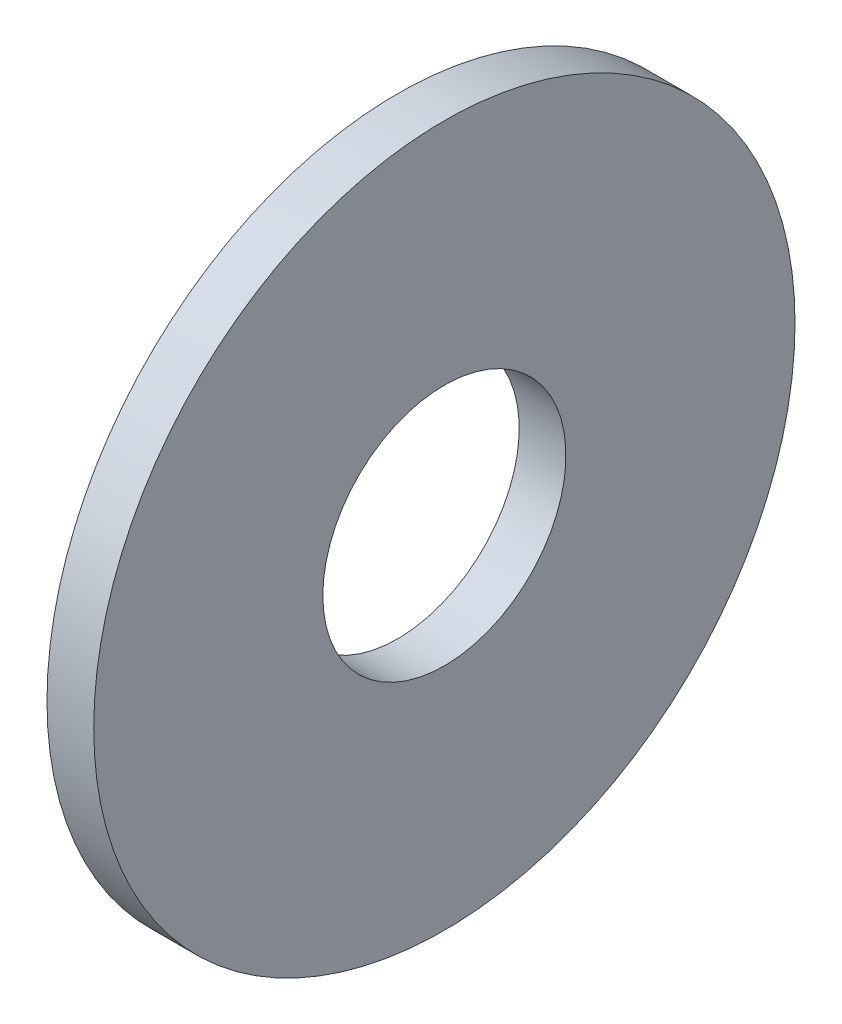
ISO-10303-21;
HEADER;
FILE_DESCRIPTION(('STEP AP214'),'2;1');
FILE_NAME('part.step','',(''),(''),'','','');
FILE_SCHEMA(('AUTOMOTIVE_DESIGN { 1 0 10303 214 1 1 1 1 }'));
ENDSEC;
DATA;
#1=APPLICATION_CONTEXT('core data for automotive mechanical design processes');
#2=APPLICATION_PROTOCOL_DEFINITION('international standard','automotive_design',2000,#1);
#3=PRODUCT_CONTEXT('',#1,'mechanical');
#4=PRODUCT('Part','Part','',(#3));
#5=PRODUCT_RELATED_PRODUCT_CATEGORY('part','',(#4));
#6=PRODUCT_DEFINITION_FORMATION('','',#4);
#7=PRODUCT_DEFINITION_CONTEXT('part definition',#1,'design');
#8=PRODUCT_DEFINITION('design','',#6,#7);
#9=PRODUCT_DEFINITION_SHAPE('','',#8);
#10=(LENGTH_UNIT() NAMED_UNIT(*) SI_UNIT(.MILLI.,.METRE.));
#11=(NAMED_UNIT(*) PLANE_ANGLE_UNIT() SI_UNIT($,.RADIAN.));
#12=(NAMED_UNIT(*) SI_UNIT($,.STERADIAN.) SOLID_ANGLE_UNIT());
#13=UNCERTAINTY_MEASURE_WITH_UNIT(LENGTH_MEASURE(1.E-05),#10,'distance_accuracy_value','');
#14=(GEOMETRIC_REPRESENTATION_CONTEXT(3) GLOBAL_UNCERTAINTY_ASSIGNED_CONTEXT((#13)) GLOBAL_UNIT_ASSIGNED_CONTEXT((#10,
#11,#12)) REPRESENTATION_CONTEXT('',''));
#15=CARTESIAN_POINT('',(0.,0.,0.));
#16=DIRECTION('',(0.,0.,1.));
#17=DIRECTION('',(1.,0.,0.));
#18=AXIS2_PLACEMENT_3D('',#15,#16,#17);
#19=CARTESIAN_POINT('',(-7.4558363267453,0.,0.));
#20=DIRECTION('',(-1.,0.,0.));
#21=DIRECTION('',(0.,0.,1.));
#22=AXIS2_PLACEMENT_3D('',#19,#20,#21);
#23=CYLINDRICAL_SURFACE('',#22,5.2);
#24=CARTESIAN_POINT('',(2.,0.,0.));
#25=DIRECTION('',(-1.,0.,0.));
#26=DIRECTION('',(0.,0.,1.));
#27=AXIS2_PLACEMENT_3D('',#24,#25,#26);
#28=CIRCLE('',#27,5.2);
#29=CARTESIAN_POINT('',(2.,0.,5.2));
#30=VERTEX_POINT('',#29);
#31=EDGE_CURVE('E10',#30,#30,#28,.T.);
#32=ORIENTED_EDGE('',*,*,#31,.F.);
#33=EDGE_LOOP('',(#32));
#34=FACE_BOUND('',#33,.T.);
#35=CARTESIAN_POINT('',(0.,0.,0.));
#36=DIRECTION('',(-1.,0.,0.));
#37=DIRECTION('',(0.,0.,1.));
#38=AXIS2_PLACEMENT_3D('',#35,#36,#37);
#39=CIRCLE('',#38,5.2);
#40=CARTESIAN_POINT('',(0.,0.,5.2));
#41=VERTEX_POINT('',#40);
#42=EDGE_CURVE('E43',#41,#41,#39,.T.);
#43=ORIENTED_EDGE('',*,*,#42,.T.);
#44=EDGE_LOOP('',(#43));
#45=FACE_BOUND('',#44,.T.);
#46=ADVANCED_FACE('F29',(#34,#45),#23,.F.);
#47=CARTESIAN_POINT('',(2.,5.2,0.));
#48=DIRECTION('',(-1.,0.,0.));
#49=DIRECTION('',(0.,0.,1.));
#50=AXIS2_PLACEMENT_3D('',#47,#48,#49);
#51=PLANE('',#50);
#52=CARTESIAN_POINT('',(2.,0.,0.));
#53=DIRECTION('',(-1.,0.,0.));
#54=DIRECTION('',(0.,0.,1.));
#55=AXIS2_PLACEMENT_3D('',#52,#53,#54);
#56=CIRCLE('',#55,15.);
#57=CARTESIAN_POINT('',(2.,0.,15.));
#58=VERTEX_POINT('',#57);
#59=EDGE_CURVE('E35',#58,#58,#56,.T.);
#60=ORIENTED_EDGE('',*,*,#59,.F.);
#61=EDGE_LOOP('',(#60));
#62=FACE_BOUND('',#61,.T.);
#63=ORIENTED_EDGE('',*,*,#31,.T.);
#64=EDGE_LOOP('',(#63));
#65=FACE_BOUND('',#64,.T.);
#66=ADVANCED_FACE('F58',(#62,#65),#51,.F.);
#67=CARTESIAN_POINT('',(-7.4558363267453,0.,0.));
#68=DIRECTION('',(-1.,0.,0.));
#69=DIRECTION('',(0.,0.,1.));
#70=AXIS2_PLACEMENT_3D('',#67,#68,#69);
#71=CYLINDRICAL_SURFACE('',#70,15.);
#72=CARTESIAN_POINT('',(0.,0.,0.));
#73=DIRECTION('',(-1.,0.,0.));
#74=DIRECTION('',(0.,0.,1.));
#75=AXIS2_PLACEMENT_3D('',#72,#73,#74);
#76=CIRCLE('',#75,15.);
#77=CARTESIAN_POINT('',(0.,0.,15.));
#78=VERTEX_POINT('',#77);
#79=EDGE_CURVE('E39',#78,#78,#76,.T.);
#80=ORIENTED_EDGE('',*,*,#79,.F.);
#81=EDGE_LOOP('',(#80));
#82=FACE_BOUND('',#81,.T.);
#83=ORIENTED_EDGE('',*,*,#59,.T.);
#84=EDGE_LOOP('',(#83));
#85=FACE_BOUND('',#84,.T.);
#86=ADVANCED_FACE('F53',(#82,#85),#71,.T.);
#87=CARTESIAN_POINT('',(0.,15.,0.));
#88=DIRECTION('',(1.,0.,0.));
#89=DIRECTION('',(0.,0.,-1.));
#90=AXIS2_PLACEMENT_3D('',#87,#88,#89);
#91=PLANE('',#90);
#92=ORIENTED_EDGE('',*,*,#42,.F.);
#93=EDGE_LOOP('',(#92));
#94=FACE_BOUND('',#93,.T.);
#95=ORIENTED_EDGE('',*,*,#79,.T.);
#96=EDGE_LOOP('',(#95));
#97=FACE_BOUND('',#96,.T.);
#98=ADVANCED_FACE('F50',(#94,#97),#91,.F.);
#99=CLOSED_SHELL('',(#46,#66,#86,#98));
#100=MANIFOLD_SOLID_BREP('B2',#99);
#101=ADVANCED_BREP_SHAPE_REPRESENTATION('',(#18,#100),#14);
#102=SHAPE_DEFINITION_REPRESENTATION(#9,#101);
ENDSEC;
END-ISO-10303-21;
